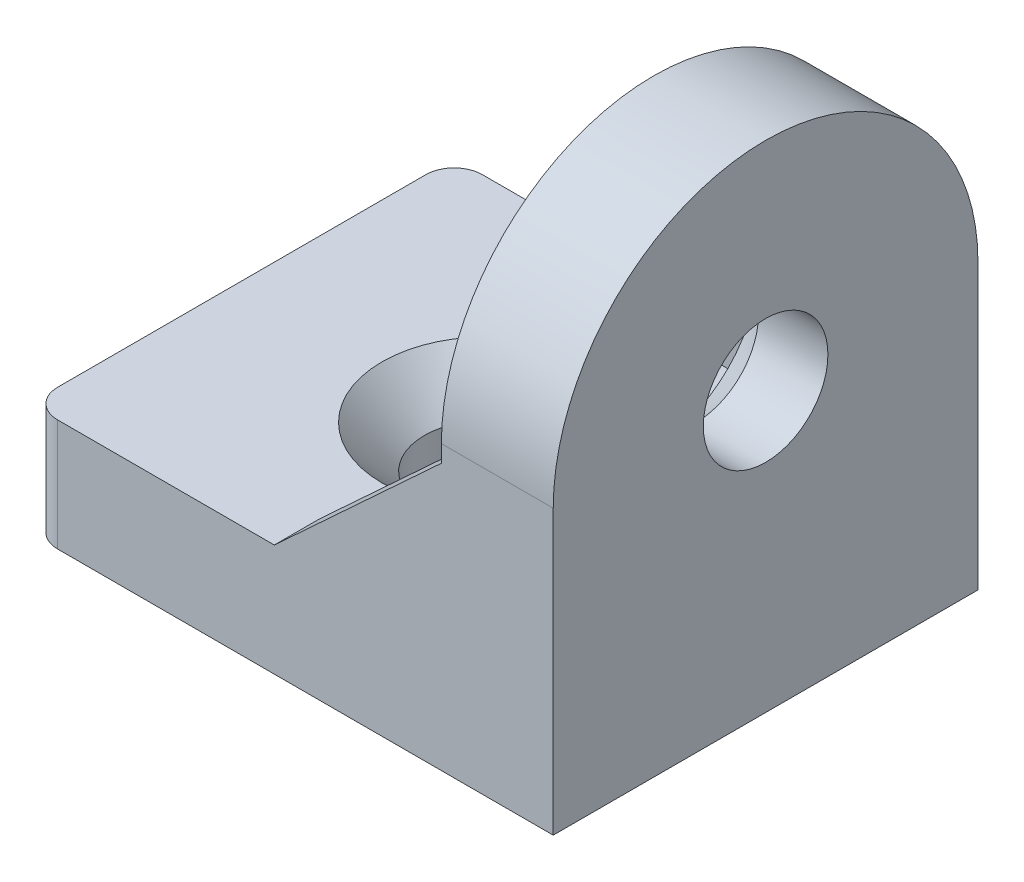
ISO-10303-21;
HEADER;
FILE_DESCRIPTION(('STEP AP214'),'2;1');
FILE_NAME('part.step','',(''),(''),'','','');
FILE_SCHEMA(('AUTOMOTIVE_DESIGN { 1 0 10303 214 1 1 1 1 }'));
ENDSEC;
DATA;
#1=APPLICATION_CONTEXT('core data for automotive mechanical design processes');
#2=APPLICATION_PROTOCOL_DEFINITION('international standard','automotive_design',2000,#1);
#3=PRODUCT_CONTEXT('',#1,'mechanical');
#4=PRODUCT('Part','Part','',(#3));
#5=PRODUCT_RELATED_PRODUCT_CATEGORY('part','',(#4));
#6=PRODUCT_DEFINITION_FORMATION('','',#4);
#7=PRODUCT_DEFINITION_CONTEXT('part definition',#1,'design');
#8=PRODUCT_DEFINITION('design','',#6,#7);
#9=PRODUCT_DEFINITION_SHAPE('','',#8);
#10=(LENGTH_UNIT() NAMED_UNIT(*) SI_UNIT(.MILLI.,.METRE.));
#11=(NAMED_UNIT(*) PLANE_ANGLE_UNIT() SI_UNIT($,.RADIAN.));
#12=(NAMED_UNIT(*) SI_UNIT($,.STERADIAN.) SOLID_ANGLE_UNIT());
#13=UNCERTAINTY_MEASURE_WITH_UNIT(LENGTH_MEASURE(1.E-05),#10,'distance_accuracy_value','');
#14=(GEOMETRIC_REPRESENTATION_CONTEXT(3) GLOBAL_UNCERTAINTY_ASSIGNED_CONTEXT((#13)) GLOBAL_UNIT_ASSIGNED_CONTEXT((#10,
#11,#12)) REPRESENTATION_CONTEXT('',''));
#15=CARTESIAN_POINT('',(0.,0.,0.));
#16=DIRECTION('',(0.,0.,1.));
#17=DIRECTION('',(1.,0.,0.));
#18=AXIS2_PLACEMENT_3D('',#15,#16,#17);
#19=CARTESIAN_POINT('',(17.3,7.9,30.));
#20=DIRECTION('',(0.678538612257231,-0.734564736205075,0.));
#21=DIRECTION('',(0.734564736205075,0.678538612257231,0.));
#22=AXIS2_PLACEMENT_3D('',#19,#20,#21);
#23=PLANE('',#22);
#24=DIRECTION('',(-0.734564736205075,-0.678538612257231,0.));
#25=VECTOR('',#24,1.);
#26=CARTESIAN_POINT('',(17.3,7.9,3.2));
#27=LINE('',#26,#25);
#28=CARTESIAN_POINT('',(29.1,18.8,3.2));
#29=VERTEX_POINT('',#28);
#30=CARTESIAN_POINT('',(17.3,7.9,3.2));
#31=VERTEX_POINT('',#30);
#32=EDGE_CURVE('E125',#29,#31,#27,.T.);
#33=ORIENTED_EDGE('',*,*,#32,.F.);
#34=DIRECTION('',(0.,0.,-1.));
#35=VECTOR('',#34,1.);
#36=CARTESIAN_POINT('',(29.1,18.8,30.));
#37=LINE('',#36,#35);
#38=CARTESIAN_POINT('',(29.1,18.8,0.));
#39=VERTEX_POINT('',#38);
#40=EDGE_CURVE('E141',#29,#39,#37,.T.);
#41=ORIENTED_EDGE('',*,*,#40,.T.);
#42=DIRECTION('',(-0.734564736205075,-0.678538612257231,0.));
#43=VECTOR('',#42,1.);
#44=CARTESIAN_POINT('',(17.3,7.9,0.));
#45=LINE('',#44,#43);
#46=CARTESIAN_POINT('',(17.3,7.9,0.));
#47=VERTEX_POINT('',#46);
#48=EDGE_CURVE('E184',#39,#47,#45,.T.);
#49=ORIENTED_EDGE('',*,*,#48,.T.);
#50=DIRECTION('',(0.,0.,-1.));
#51=VECTOR('',#50,1.);
#52=CARTESIAN_POINT('',(17.3,7.9,30.));
#53=LINE('',#52,#51);
#54=EDGE_CURVE('E189',#31,#47,#53,.T.);
#55=ORIENTED_EDGE('',*,*,#54,.F.);
#56=EDGE_LOOP('',(#33,#41,#49,#55));
#57=FACE_BOUND('',#56,.T.);
#58=ADVANCED_FACE('F30',(#57),#23,.F.);
#59=DIRECTION('',(0.734564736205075,0.678538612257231,0.));
#60=VECTOR('',#59,1.);
#61=CARTESIAN_POINT('',(17.3,7.9,26.8));
#62=LINE('',#61,#60);
#63=CARTESIAN_POINT('',(17.3,7.9,26.8));
#64=VERTEX_POINT('',#63);
#65=CARTESIAN_POINT('',(29.1,18.8,26.8));
#66=VERTEX_POINT('',#65);
#67=EDGE_CURVE('E127',#64,#66,#62,.T.);
#68=ORIENTED_EDGE('',*,*,#67,.F.);
#69=CARTESIAN_POINT('',(17.3,7.9,30.));
#70=VERTEX_POINT('',#69);
#71=EDGE_CURVE('E190',#70,#64,#53,.T.);
#72=ORIENTED_EDGE('',*,*,#71,.F.);
#73=DIRECTION('',(-0.734564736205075,-0.678538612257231,0.));
#74=VECTOR('',#73,1.);
#75=CARTESIAN_POINT('',(17.3,7.9,30.));
#76=LINE('',#75,#74);
#77=CARTESIAN_POINT('',(29.1,18.8,30.));
#78=VERTEX_POINT('',#77);
#79=EDGE_CURVE('E172',#78,#70,#76,.T.);
#80=ORIENTED_EDGE('',*,*,#79,.F.);
#81=EDGE_CURVE('E192',#78,#66,#37,.T.);
#82=ORIENTED_EDGE('',*,*,#81,.T.);
#83=EDGE_LOOP('',(#68,#72,#80,#82));
#84=FACE_BOUND('',#83,.T.);
#85=ADVANCED_FACE('F258',(#84),#23,.F.);
#86=CARTESIAN_POINT('',(37.,0.,30.));
#87=DIRECTION('',(-1.,0.,0.));
#88=DIRECTION('',(0.,0.,1.));
#89=AXIS2_PLACEMENT_3D('',#86,#87,#88);
#90=PLANE('',#89);
#91=CARTESIAN_POINT('',(37.,19.7,15.));
#92=DIRECTION('',(-1.,0.,0.));
#93=DIRECTION('',(0.,0.,1.));
#94=AXIS2_PLACEMENT_3D('',#91,#92,#93);
#95=CIRCLE('',#94,4.4);
#96=CARTESIAN_POINT('',(37.,19.7,19.4));
#97=VERTEX_POINT('',#96);
#98=EDGE_CURVE('E142',#97,#97,#95,.T.);
#99=ORIENTED_EDGE('',*,*,#98,.T.);
#100=EDGE_LOOP('',(#99));
#101=FACE_BOUND('',#100,.T.);
#102=CARTESIAN_POINT('',(37.,20.,15.));
#103=DIRECTION('',(-1.,0.,0.));
#104=DIRECTION('',(0.,0.,1.));
#105=AXIS2_PLACEMENT_3D('',#102,#103,#104);
#106=CIRCLE('',#105,15.);
#107=CARTESIAN_POINT('',(37.,20.,30.));
#108=VERTEX_POINT('',#107);
#109=CARTESIAN_POINT('',(37.,20.,0.));
#110=VERTEX_POINT('',#109);
#111=EDGE_CURVE('E159',#108,#110,#106,.T.);
#112=ORIENTED_EDGE('',*,*,#111,.F.);
#113=DIRECTION('',(0.,1.,0.));
#114=VECTOR('',#113,1.);
#115=CARTESIAN_POINT('',(37.,0.,30.));
#116=LINE('',#115,#114);
#117=CARTESIAN_POINT('',(37.,0.,30.));
#118=VERTEX_POINT('',#117);
#119=EDGE_CURVE('E166',#118,#108,#116,.T.);
#120=ORIENTED_EDGE('',*,*,#119,.F.);
#121=DIRECTION('',(0.,0.,-1.));
#122=VECTOR('',#121,1.);
#123=CARTESIAN_POINT('',(37.,0.,30.));
#124=LINE('',#123,#122);
#125=CARTESIAN_POINT('',(37.,0.,0.));
#126=VERTEX_POINT('',#125);
#127=EDGE_CURVE('E195',#118,#126,#124,.T.);
#128=ORIENTED_EDGE('',*,*,#127,.T.);
#129=DIRECTION('',(0.,1.,0.));
#130=VECTOR('',#129,1.);
#131=CARTESIAN_POINT('',(37.,0.,0.));
#132=LINE('',#131,#130);
#133=EDGE_CURVE('E179',#126,#110,#132,.T.);
#134=ORIENTED_EDGE('',*,*,#133,.T.);
#135=EDGE_LOOP('',(#112,#120,#128,#134));
#136=FACE_BOUND('',#135,.T.);
#137=ADVANCED_FACE('F250',(#101,#136),#90,.F.);
#138=CARTESIAN_POINT('',(29.1,35.,30.));
#139=DIRECTION('',(1.,0.,0.));
#140=DIRECTION('',(0.,1.,0.));
#141=AXIS2_PLACEMENT_3D('',#138,#139,#140);
#142=PLANE('',#141);
#143=CARTESIAN_POINT('',(29.1,19.7,15.));
#144=DIRECTION('',(1.,0.,0.));
#145=DIRECTION('',(0.,1.,0.));
#146=AXIS2_PLACEMENT_3D('',#143,#144,#145);
#147=CIRCLE('',#146,7.39999999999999);
#148=CARTESIAN_POINT('',(29.1,27.1,15.));
#149=VERTEX_POINT('',#148);
#150=EDGE_CURVE('E204',#149,#149,#147,.T.);
#151=ORIENTED_EDGE('',*,*,#150,.T.);
#152=EDGE_LOOP('',(#151));
#153=FACE_BOUND('',#152,.T.);
#154=CARTESIAN_POINT('',(29.1,20.,15.));
#155=DIRECTION('',(1.,0.,0.));
#156=DIRECTION('',(0.,1.,0.));
#157=AXIS2_PLACEMENT_3D('',#154,#155,#156);
#158=CIRCLE('',#157,15.);
#159=CARTESIAN_POINT('',(29.1,20.,0.));
#160=VERTEX_POINT('',#159);
#161=CARTESIAN_POINT('',(29.1,20.,30.));
#162=VERTEX_POINT('',#161);
#163=EDGE_CURVE('E155',#160,#162,#158,.T.);
#164=ORIENTED_EDGE('',*,*,#163,.F.);
#165=DIRECTION('',(0.,-1.,0.));
#166=VECTOR('',#165,1.);
#167=CARTESIAN_POINT('',(29.1,35.,0.));
#168=LINE('',#167,#166);
#169=EDGE_CURVE('E182',#160,#39,#168,.T.);
#170=ORIENTED_EDGE('',*,*,#169,.T.);
#171=ORIENTED_EDGE('',*,*,#40,.F.);
#172=DIRECTION('',(0.,-1.,0.));
#173=VECTOR('',#172,1.);
#174=CARTESIAN_POINT('',(29.1,7.9,3.2));
#175=LINE('',#174,#173);
#176=CARTESIAN_POINT('',(29.1,7.9,3.2));
#177=VERTEX_POINT('',#176);
#178=EDGE_CURVE('E123',#29,#177,#175,.T.);
#179=ORIENTED_EDGE('',*,*,#178,.T.);
#180=DIRECTION('',(0.,0.,1.));
#181=VECTOR('',#180,1.);
#182=CARTESIAN_POINT('',(29.1,7.9,3.2));
#183=LINE('',#182,#181);
#184=CARTESIAN_POINT('',(29.1,7.9,26.8));
#185=VERTEX_POINT('',#184);
#186=EDGE_CURVE('E131',#177,#185,#183,.T.);
#187=ORIENTED_EDGE('',*,*,#186,.T.);
#188=DIRECTION('',(0.,1.,0.));
#189=VECTOR('',#188,1.);
#190=CARTESIAN_POINT('',(29.1,7.9,26.8));
#191=LINE('',#190,#189);
#192=EDGE_CURVE('E136',#185,#66,#191,.T.);
#193=ORIENTED_EDGE('',*,*,#192,.T.);
#194=ORIENTED_EDGE('',*,*,#81,.F.);
#195=DIRECTION('',(0.,-1.,0.));
#196=VECTOR('',#195,1.);
#197=CARTESIAN_POINT('',(29.1,35.,30.));
#198=LINE('',#197,#196);
#199=EDGE_CURVE('E170',#162,#78,#198,.T.);
#200=ORIENTED_EDGE('',*,*,#199,.F.);
#201=EDGE_LOOP('',(#164,#170,#171,#179,#187,#193,#194,#200));
#202=FACE_BOUND('',#201,.T.);
#203=ADVANCED_FACE('F139',(#153,#202),#142,.F.);
#204=CARTESIAN_POINT('',(0.,7.9,30.));
#205=DIRECTION('',(1.,0.,0.));
#206=DIRECTION('',(0.,1.,0.));
#207=AXIS2_PLACEMENT_3D('',#204,#205,#206);
#208=PLANE('',#207);
#209=DIRECTION('',(0.,0.,-1.));
#210=VECTOR('',#209,1.);
#211=CARTESIAN_POINT('',(0.,0.,30.));
#212=LINE('',#211,#210);
#213=CARTESIAN_POINT('',(0.,0.,28.));
#214=VERTEX_POINT('',#213);
#215=CARTESIAN_POINT('',(0.,0.,2.));
#216=VERTEX_POINT('',#215);
#217=EDGE_CURVE('E198',#214,#216,#212,.T.);
#218=ORIENTED_EDGE('',*,*,#217,.F.);
#219=DIRECTION('',(0.,-1.,0.));
#220=VECTOR('',#219,1.);
#221=CARTESIAN_POINT('',(0.,7.9,28.));
#222=LINE('',#221,#220);
#223=CARTESIAN_POINT('',(0.,7.9,28.));
#224=VERTEX_POINT('',#223);
#225=EDGE_CURVE('E223',#214,#224,#222,.F.);
#226=ORIENTED_EDGE('',*,*,#225,.T.);
#227=DIRECTION('',(0.,0.,-1.));
#228=VECTOR('',#227,1.);
#229=CARTESIAN_POINT('',(0.,7.9,30.));
#230=LINE('',#229,#228);
#231=CARTESIAN_POINT('',(0.,7.9,2.));
#232=VERTEX_POINT('',#231);
#233=EDGE_CURVE('E177',#224,#232,#230,.T.);
#234=ORIENTED_EDGE('',*,*,#233,.T.);
#235=DIRECTION('',(0.,-1.,0.));
#236=VECTOR('',#235,1.);
#237=CARTESIAN_POINT('',(0.,7.9,2.));
#238=LINE('',#237,#236);
#239=EDGE_CURVE('E220',#232,#216,#238,.T.);
#240=ORIENTED_EDGE('',*,*,#239,.T.);
#241=EDGE_LOOP('',(#218,#226,#234,#240));
#242=FACE_BOUND('',#241,.T.);
#243=ADVANCED_FACE('F241',(#242),#208,.F.);
#244=CARTESIAN_POINT('',(0.,0.,30.));
#245=DIRECTION('',(0.,1.,0.));
#246=DIRECTION('',(0.,0.,1.));
#247=AXIS2_PLACEMENT_3D('',#244,#245,#246);
#248=PLANE('',#247);
#249=CARTESIAN_POINT('',(17.3,0.,15.));
#250=DIRECTION('',(0.,1.,0.));
#251=DIRECTION('',(0.,0.,1.));
#252=AXIS2_PLACEMENT_3D('',#249,#250,#251);
#253=CIRCLE('',#252,4.4);
#254=CARTESIAN_POINT('',(17.3,0.,19.4));
#255=VERTEX_POINT('',#254);
#256=EDGE_CURVE('E145',#255,#255,#253,.T.);
#257=ORIENTED_EDGE('',*,*,#256,.T.);
#258=EDGE_LOOP('',(#257));
#259=FACE_BOUND('',#258,.T.);
#260=DIRECTION('',(1.,0.,0.));
#261=VECTOR('',#260,1.);
#262=CARTESIAN_POINT('',(0.,0.,30.));
#263=LINE('',#262,#261);
#264=CARTESIAN_POINT('',(2.,0.,30.));
#265=VERTEX_POINT('',#264);
#266=EDGE_CURVE('E164',#265,#118,#263,.T.);
#267=ORIENTED_EDGE('',*,*,#266,.F.);
#268=CARTESIAN_POINT('',(2.,0.,28.));
#269=DIRECTION('',(0.,1.,0.));
#270=DIRECTION('',(0.,0.,1.));
#271=AXIS2_PLACEMENT_3D('',#268,#269,#270);
#272=CIRCLE('',#271,2.);
#273=EDGE_CURVE('E218',#265,#214,#272,.F.);
#274=ORIENTED_EDGE('',*,*,#273,.T.);
#275=ORIENTED_EDGE('',*,*,#217,.T.);
#276=CARTESIAN_POINT('',(2.,0.,2.));
#277=DIRECTION('',(0.,1.,0.));
#278=DIRECTION('',(0.,0.,1.));
#279=AXIS2_PLACEMENT_3D('',#276,#277,#278);
#280=CIRCLE('',#279,2.);
#281=CARTESIAN_POINT('',(2.,0.,0.));
#282=VERTEX_POINT('',#281);
#283=EDGE_CURVE('E216',#216,#282,#280,.F.);
#284=ORIENTED_EDGE('',*,*,#283,.T.);
#285=DIRECTION('',(1.,0.,0.));
#286=VECTOR('',#285,1.);
#287=CARTESIAN_POINT('',(0.,0.,0.));
#288=LINE('',#287,#286);
#289=EDGE_CURVE('E163',#282,#126,#288,.T.);
#290=ORIENTED_EDGE('',*,*,#289,.T.);
#291=ORIENTED_EDGE('',*,*,#127,.F.);
#292=EDGE_LOOP('',(#267,#274,#275,#284,#290,#291));
#293=FACE_BOUND('',#292,.T.);
#294=ADVANCED_FACE('F238',(#259,#293),#248,.F.);
#295=CARTESIAN_POINT('',(17.3,7.9,30.));
#296=DIRECTION('',(0.,-1.,0.));
#297=DIRECTION('',(0.,0.,-1.));
#298=AXIS2_PLACEMENT_3D('',#295,#296,#297);
#299=PLANE('',#298);
#300=CARTESIAN_POINT('',(17.3,7.9,15.));
#301=DIRECTION('',(0.,-1.,0.));
#302=DIRECTION('',(0.,0.,-1.));
#303=AXIS2_PLACEMENT_3D('',#300,#301,#302);
#304=CIRCLE('',#303,7.4);
#305=CARTESIAN_POINT('',(9.9,7.9,15.));
#306=VERTEX_POINT('',#305);
#307=EDGE_CURVE('E210',#306,#306,#304,.T.);
#308=ORIENTED_EDGE('',*,*,#307,.T.);
#309=EDGE_LOOP('',(#308));
#310=FACE_BOUND('',#309,.T.);
#311=ORIENTED_EDGE('',*,*,#233,.F.);
#312=CARTESIAN_POINT('',(2.,7.9,28.));
#313=DIRECTION('',(0.,-1.,0.));
#314=DIRECTION('',(0.,0.,-1.));
#315=AXIS2_PLACEMENT_3D('',#312,#313,#314);
#316=CIRCLE('',#315,2.);
#317=CARTESIAN_POINT('',(2.,7.9,30.));
#318=VERTEX_POINT('',#317);
#319=EDGE_CURVE('E38',#224,#318,#316,.F.);
#320=ORIENTED_EDGE('',*,*,#319,.T.);
#321=DIRECTION('',(-1.,0.,0.));
#322=VECTOR('',#321,1.);
#323=CARTESIAN_POINT('',(17.3,7.9,30.));
#324=LINE('',#323,#322);
#325=EDGE_CURVE('E174',#70,#318,#324,.T.);
#326=ORIENTED_EDGE('',*,*,#325,.F.);
#327=ORIENTED_EDGE('',*,*,#71,.T.);
#328=DIRECTION('',(1.,0.,0.));
#329=VECTOR('',#328,1.);
#330=CARTESIAN_POINT('',(12.1,7.9,26.8));
#331=LINE('',#330,#329);
#332=EDGE_CURVE('E128',#64,#185,#331,.T.);
#333=ORIENTED_EDGE('',*,*,#332,.T.);
#334=ORIENTED_EDGE('',*,*,#186,.F.);
#335=DIRECTION('',(1.,0.,0.));
#336=VECTOR('',#335,1.);
#337=CARTESIAN_POINT('',(12.1,7.9,3.2));
#338=LINE('',#337,#336);
#339=EDGE_CURVE('E119',#31,#177,#338,.T.);
#340=ORIENTED_EDGE('',*,*,#339,.F.);
#341=ORIENTED_EDGE('',*,*,#54,.T.);
#342=DIRECTION('',(-1.,0.,0.));
#343=VECTOR('',#342,1.);
#344=CARTESIAN_POINT('',(17.3,7.9,0.));
#345=LINE('',#344,#343);
#346=CARTESIAN_POINT('',(2.,7.9,0.));
#347=VERTEX_POINT('',#346);
#348=EDGE_CURVE('E167',#47,#347,#345,.T.);
#349=ORIENTED_EDGE('',*,*,#348,.T.);
#350=CARTESIAN_POINT('',(2.,7.9,2.));
#351=DIRECTION('',(0.,-1.,0.));
#352=DIRECTION('',(0.,0.,-1.));
#353=AXIS2_PLACEMENT_3D('',#350,#351,#352);
#354=CIRCLE('',#353,2.);
#355=EDGE_CURVE('E50',#347,#232,#354,.F.);
#356=ORIENTED_EDGE('',*,*,#355,.T.);
#357=EDGE_LOOP('',(#311,#320,#326,#327,#333,#334,#340,#341,#349,#356));
#358=FACE_BOUND('',#357,.T.);
#359=ADVANCED_FACE('F132',(#310,#358),#299,.F.);
#360=CARTESIAN_POINT('',(0.,0.,30.));
#361=DIRECTION('',(0.,0.,1.));
#362=DIRECTION('',(1.,0.,0.));
#363=AXIS2_PLACEMENT_3D('',#360,#361,#362);
#364=PLANE('',#363);
#365=ORIENTED_EDGE('',*,*,#325,.T.);
#366=DIRECTION('',(0.,-1.,0.));
#367=VECTOR('',#366,1.);
#368=CARTESIAN_POINT('',(2.,0.,30.));
#369=LINE('',#368,#367);
#370=EDGE_CURVE('E213',#318,#265,#369,.T.);
#371=ORIENTED_EDGE('',*,*,#370,.T.);
#372=ORIENTED_EDGE('',*,*,#266,.T.);
#373=ORIENTED_EDGE('',*,*,#119,.T.);
#374=DIRECTION('',(1.,0.,0.));
#375=VECTOR('',#374,1.);
#376=CARTESIAN_POINT('',(29.1,20.,30.));
#377=LINE('',#376,#375);
#378=EDGE_CURVE('E157',#162,#108,#377,.T.);
#379=ORIENTED_EDGE('',*,*,#378,.F.);
#380=ORIENTED_EDGE('',*,*,#199,.T.);
#381=ORIENTED_EDGE('',*,*,#79,.T.);
#382=EDGE_LOOP('',(#365,#371,#372,#373,#379,#380,#381));
#383=FACE_BOUND('',#382,.T.);
#384=ADVANCED_FACE('F231',(#383),#364,.T.);
#385=CARTESIAN_POINT('',(0.,0.,0.));
#386=DIRECTION('',(0.,0.,1.));
#387=DIRECTION('',(1.,0.,0.));
#388=AXIS2_PLACEMENT_3D('',#385,#386,#387);
#389=PLANE('',#388);
#390=ORIENTED_EDGE('',*,*,#289,.F.);
#391=DIRECTION('',(0.,-1.,0.));
#392=VECTOR('',#391,1.);
#393=CARTESIAN_POINT('',(2.,0.,0.));
#394=LINE('',#393,#392);
#395=EDGE_CURVE('E11',#282,#347,#394,.F.);
#396=ORIENTED_EDGE('',*,*,#395,.T.);
#397=ORIENTED_EDGE('',*,*,#348,.F.);
#398=ORIENTED_EDGE('',*,*,#48,.F.);
#399=ORIENTED_EDGE('',*,*,#169,.F.);
#400=DIRECTION('',(1.,0.,0.));
#401=VECTOR('',#400,1.);
#402=CARTESIAN_POINT('',(29.1,20.,0.));
#403=LINE('',#402,#401);
#404=EDGE_CURVE('E154',#160,#110,#403,.T.);
#405=ORIENTED_EDGE('',*,*,#404,.T.);
#406=ORIENTED_EDGE('',*,*,#133,.F.);
#407=EDGE_LOOP('',(#390,#396,#397,#398,#399,#405,#406));
#408=FACE_BOUND('',#407,.T.);
#409=ADVANCED_FACE('F245',(#408),#389,.F.);
#410=CARTESIAN_POINT('',(29.1,20.,15.));
#411=DIRECTION('',(1.,0.,0.));
#412=DIRECTION('',(0.,1.,0.));
#413=AXIS2_PLACEMENT_3D('',#410,#411,#412);
#414=CYLINDRICAL_SURFACE('',#413,15.);
#415=ORIENTED_EDGE('',*,*,#378,.T.);
#416=ORIENTED_EDGE('',*,*,#111,.T.);
#417=ORIENTED_EDGE('',*,*,#404,.F.);
#418=ORIENTED_EDGE('',*,*,#163,.T.);
#419=EDGE_LOOP('',(#415,#416,#417,#418));
#420=FACE_BOUND('',#419,.T.);
#421=ADVANCED_FACE('F271',(#420),#414,.T.);
#422=CARTESIAN_POINT('',(12.1,7.9,3.2));
#423=DIRECTION('',(0.,0.,1.));
#424=DIRECTION('',(0.,-1.,0.));
#425=AXIS2_PLACEMENT_3D('',#422,#423,#424);
#426=PLANE('',#425);
#427=ORIENTED_EDGE('',*,*,#32,.T.);
#428=ORIENTED_EDGE('',*,*,#339,.T.);
#429=ORIENTED_EDGE('',*,*,#178,.F.);
#430=EDGE_LOOP('',(#427,#428,#429));
#431=FACE_BOUND('',#430,.T.);
#432=ADVANCED_FACE('F121',(#431),#426,.T.);
#433=CARTESIAN_POINT('',(12.1,7.9,26.8));
#434=DIRECTION('',(0.,0.,-1.));
#435=DIRECTION('',(-1.,0.,0.));
#436=AXIS2_PLACEMENT_3D('',#433,#434,#435);
#437=PLANE('',#436);
#438=ORIENTED_EDGE('',*,*,#67,.T.);
#439=ORIENTED_EDGE('',*,*,#192,.F.);
#440=ORIENTED_EDGE('',*,*,#332,.F.);
#441=EDGE_LOOP('',(#438,#439,#440));
#442=FACE_BOUND('',#441,.T.);
#443=ADVANCED_FACE('F260',(#442),#437,.T.);
#444=CARTESIAN_POINT('',(46.1,19.7,15.));
#445=DIRECTION('',(-1.,0.,0.));
#446=DIRECTION('',(0.,-1.,0.));
#447=AXIS2_PLACEMENT_3D('',#444,#445,#446);
#448=CYLINDRICAL_SURFACE('',#447,4.4);
#449=CARTESIAN_POINT('',(32.1,19.7,15.));
#450=DIRECTION('',(1.,0.,0.));
#451=DIRECTION('',(0.,0.,-1.));
#452=AXIS2_PLACEMENT_3D('',#449,#450,#451);
#453=CIRCLE('',#452,4.4);
#454=CARTESIAN_POINT('',(32.1,19.7,10.6));
#455=VERTEX_POINT('',#454);
#456=EDGE_CURVE('E201',#455,#455,#453,.F.);
#457=ORIENTED_EDGE('',*,*,#456,.T.);
#458=EDGE_LOOP('',(#457));
#459=FACE_BOUND('',#458,.T.);
#460=ORIENTED_EDGE('',*,*,#98,.F.);
#461=EDGE_LOOP('',(#460));
#462=FACE_BOUND('',#461,.T.);
#463=ADVANCED_FACE('F262',(#459,#462),#448,.F.);
#464=CARTESIAN_POINT('',(32.1,19.7,15.));
#465=DIRECTION('',(-1.,0.,0.));
#466=DIRECTION('',(0.,0.,1.));
#467=AXIS2_PLACEMENT_3D('',#464,#465,#466);
#468=CONICAL_SURFACE('',#467,4.4,0.78539816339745);
#469=ORIENTED_EDGE('',*,*,#150,.F.);
#470=EDGE_LOOP('',(#469));
#471=FACE_BOUND('',#470,.T.);
#472=ORIENTED_EDGE('',*,*,#456,.F.);
#473=EDGE_LOOP('',(#472));
#474=FACE_BOUND('',#473,.T.);
#475=ADVANCED_FACE('F268',(#471,#474),#468,.F.);
#476=CARTESIAN_POINT('',(17.3,-9.1,15.));
#477=DIRECTION('',(0.,1.,0.));
#478=DIRECTION('',(-1.,0.,0.));
#479=AXIS2_PLACEMENT_3D('',#476,#477,#478);
#480=CYLINDRICAL_SURFACE('',#479,4.4);
#481=CARTESIAN_POINT('',(17.3,4.90000000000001,15.));
#482=DIRECTION('',(0.,-1.,0.));
#483=DIRECTION('',(1.,0.,0.));
#484=AXIS2_PLACEMENT_3D('',#481,#482,#483);
#485=CIRCLE('',#484,4.4);
#486=CARTESIAN_POINT('',(12.9,4.90000000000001,15.));
#487=VERTEX_POINT('',#486);
#488=EDGE_CURVE('E207',#487,#487,#485,.F.);
#489=ORIENTED_EDGE('',*,*,#488,.T.);
#490=EDGE_LOOP('',(#489));
#491=FACE_BOUND('',#490,.T.);
#492=ORIENTED_EDGE('',*,*,#256,.F.);
#493=EDGE_LOOP('',(#492));
#494=FACE_BOUND('',#493,.T.);
#495=ADVANCED_FACE('F295',(#491,#494),#480,.F.);
#496=CARTESIAN_POINT('',(17.3,4.90000000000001,15.));
#497=DIRECTION('',(0.,1.,0.));
#498=DIRECTION('',(-1.,0.,0.));
#499=AXIS2_PLACEMENT_3D('',#496,#497,#498);
#500=CONICAL_SURFACE('',#499,4.4,0.785398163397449);
#501=CARTESIAN_POINT('',(9.9,7.9,15.));
#502=CARTESIAN_POINT('',(9.93125,7.86875,15.));
#503=CARTESIAN_POINT('',(9.9625,7.8375,15.));
#504=CARTESIAN_POINT('',(10.025,7.775,15.));
#505=CARTESIAN_POINT('',(10.05625,7.74375,15.));
#506=CARTESIAN_POINT('',(10.11875,7.68125,15.));
#507=CARTESIAN_POINT('',(10.15,7.65,15.));
#508=CARTESIAN_POINT('',(10.2125,7.5875,15.));
#509=CARTESIAN_POINT('',(10.24375,7.55625,15.));
#510=CARTESIAN_POINT('',(10.30625,7.49375,15.));
#511=CARTESIAN_POINT('',(10.3375,7.4625,15.));
#512=CARTESIAN_POINT('',(10.4,7.4,15.));
#513=CARTESIAN_POINT('',(10.43125,7.36875,15.));
#514=CARTESIAN_POINT('',(10.49375,7.30625,15.));
#515=CARTESIAN_POINT('',(10.525,7.275,15.));
#516=CARTESIAN_POINT('',(10.5875,7.2125,15.));
#517=CARTESIAN_POINT('',(10.61875,7.18125,15.));
#518=CARTESIAN_POINT('',(10.68125,7.11875,15.));
#519=CARTESIAN_POINT('',(10.7125,7.0875,15.));
#520=CARTESIAN_POINT('',(10.775,7.025,15.));
#521=CARTESIAN_POINT('',(10.80625,6.99375,15.));
#522=CARTESIAN_POINT('',(10.86875,6.93125,15.));
#523=CARTESIAN_POINT('',(10.9,6.9,15.));
#524=CARTESIAN_POINT('',(10.9625,6.8375,15.));
#525=CARTESIAN_POINT('',(10.99375,6.80625,15.));
#526=CARTESIAN_POINT('',(11.05625,6.74375,15.));
#527=CARTESIAN_POINT('',(11.0875,6.7125,15.));
#528=CARTESIAN_POINT('',(11.15,6.65,15.));
#529=CARTESIAN_POINT('',(11.18125,6.61875,15.));
#530=CARTESIAN_POINT('',(11.24375,6.55625,15.));
#531=CARTESIAN_POINT('',(11.275,6.525,15.));
#532=CARTESIAN_POINT('',(11.3375,6.4625,15.));
#533=CARTESIAN_POINT('',(11.36875,6.43125,15.));
#534=CARTESIAN_POINT('',(11.43125,6.36875,15.));
#535=CARTESIAN_POINT('',(11.4625,6.3375,15.));
#536=CARTESIAN_POINT('',(11.525,6.275,15.));
#537=CARTESIAN_POINT('',(11.55625,6.24375,15.));
#538=CARTESIAN_POINT('',(11.61875,6.18125,15.));
#539=CARTESIAN_POINT('',(11.65,6.15,15.));
#540=CARTESIAN_POINT('',(11.7125,6.0875,15.));
#541=CARTESIAN_POINT('',(11.74375,6.05625,15.));
#542=CARTESIAN_POINT('',(11.80625,5.99375,15.));
#543=CARTESIAN_POINT('',(11.8375,5.9625,15.));
#544=CARTESIAN_POINT('',(11.9,5.9,15.));
#545=CARTESIAN_POINT('',(11.93125,5.86875,15.));
#546=CARTESIAN_POINT('',(11.99375,5.80625,15.));
#547=CARTESIAN_POINT('',(12.025,5.775,15.));
#548=CARTESIAN_POINT('',(12.0875,5.7125,15.));
#549=CARTESIAN_POINT('',(12.11875,5.68125,15.));
#550=CARTESIAN_POINT('',(12.18125,5.61875,15.));
#551=CARTESIAN_POINT('',(12.2125,5.5875,15.));
#552=CARTESIAN_POINT('',(12.275,5.525,15.));
#553=CARTESIAN_POINT('',(12.30625,5.49375,15.));
#554=CARTESIAN_POINT('',(12.36875,5.43125,15.));
#555=CARTESIAN_POINT('',(12.4,5.4,15.));
#556=CARTESIAN_POINT('',(12.4625,5.3375,15.));
#557=CARTESIAN_POINT('',(12.49375,5.30625000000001,15.));
#558=CARTESIAN_POINT('',(12.55625,5.24375000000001,15.));
#559=CARTESIAN_POINT('',(12.5875,5.21250000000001,15.));
#560=CARTESIAN_POINT('',(12.65,5.15000000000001,15.));
#561=CARTESIAN_POINT('',(12.68125,5.11875000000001,15.));
#562=CARTESIAN_POINT('',(12.74375,5.05625,15.));
#563=CARTESIAN_POINT('',(12.775,5.025,15.));
#564=CARTESIAN_POINT('',(12.8375,4.9625,15.));
#565=CARTESIAN_POINT('',(12.86875,4.93125,15.));
#566=CARTESIAN_POINT('',(12.9,4.9,15.));
#567=B_SPLINE_CURVE_WITH_KNOTS('',3,(#501,#502,#503,#504,#505,#506,#507,#508,#509,#510,#511,
#512,#513,#514,#515,#516,#517,#518,#519,#520,#521,#522,#523,#524,#525,#526,#527,#528,#529,#530,
#531,#532,#533,#534,#535,#536,#537,#538,#539,#540,#541,#542,#543,#544,#545,#546,#547,#548,#549,
#550,#551,#552,#553,#554,#555,#556,#557,#558,#559,#560,#561,#562,#563,#564,#565,#566),
.UNSPECIFIED.,.F.,.F.,(4,2,2,2,2,2,2,2,2,2,2,2,2,2,2,2,2,2,2,2,2,2,2,2,2,2,2,2,2,2,2,2,4),(0.,
0.132582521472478,0.265165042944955,0.397747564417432,0.53033008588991,0.662912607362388,
0.795495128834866,0.928077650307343,1.06066017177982,1.1932426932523,1.32582521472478,
1.45840773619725,1.59099025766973,1.72357277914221,1.85615530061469,1.98873782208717,
2.12132034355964,2.25390286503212,2.3864853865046,2.51906790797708,2.65165042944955,
2.78423295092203,2.91681547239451,3.04939799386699,3.18198051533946,3.31456303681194,
3.44714555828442,3.5797280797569,3.71231060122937,3.84489312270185,3.97747564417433,
4.11005816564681,4.24264068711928),.UNSPECIFIED.);
#568=EDGE_CURVE('BSEAM297',#306,#487,#567,.T.);
#569=ORIENTED_EDGE('',*,*,#307,.F.);
#570=ORIENTED_EDGE('',*,*,#488,.F.);
#571=ORIENTED_EDGE('',*,*,#568,.T.);
#572=ORIENTED_EDGE('',*,*,#568,.F.);
#573=EDGE_LOOP('',(#569,#571,#570,#572));
#574=FACE_BOUND('',#573,.T.);
#575=ADVANCED_FACE('F297',(#574),#500,.F.);
#576=CARTESIAN_POINT('',(2.,0.,28.));
#577=DIRECTION('',(0.,1.,0.));
#578=DIRECTION('',(-1.,0.,0.));
#579=AXIS2_PLACEMENT_3D('',#576,#577,#578);
#580=CYLINDRICAL_SURFACE('',#579,2.);
#581=ORIENTED_EDGE('',*,*,#319,.F.);
#582=ORIENTED_EDGE('',*,*,#225,.F.);
#583=ORIENTED_EDGE('',*,*,#273,.F.);
#584=ORIENTED_EDGE('',*,*,#370,.F.);
#585=EDGE_LOOP('',(#581,#582,#583,#584));
#586=FACE_BOUND('',#585,.T.);
#587=ADVANCED_FACE('F235',(#586),#580,.T.);
#588=CARTESIAN_POINT('',(2.,7.9,2.));
#589=DIRECTION('',(0.,-1.,0.));
#590=DIRECTION('',(1.,0.,0.));
#591=AXIS2_PLACEMENT_3D('',#588,#589,#590);
#592=CYLINDRICAL_SURFACE('',#591,2.);
#593=ORIENTED_EDGE('',*,*,#355,.F.);
#594=ORIENTED_EDGE('',*,*,#395,.F.);
#595=ORIENTED_EDGE('',*,*,#283,.F.);
#596=ORIENTED_EDGE('',*,*,#239,.F.);
#597=EDGE_LOOP('',(#593,#594,#595,#596));
#598=FACE_BOUND('',#597,.T.);
#599=ADVANCED_FACE('F32',(#598),#592,.T.);
#600=CLOSED_SHELL('',(#58,#85,#137,#203,#243,#294,#359,#384,#409,#421,#432,#443,#463,#475,#495,
#575,#587,#599));
#601=MANIFOLD_SOLID_BREP('B2',#600);
#602=ADVANCED_BREP_SHAPE_REPRESENTATION('',(#18,#601),#14);
#603=SHAPE_DEFINITION_REPRESENTATION(#9,#602);
ENDSEC;
END-ISO-10303-21;
